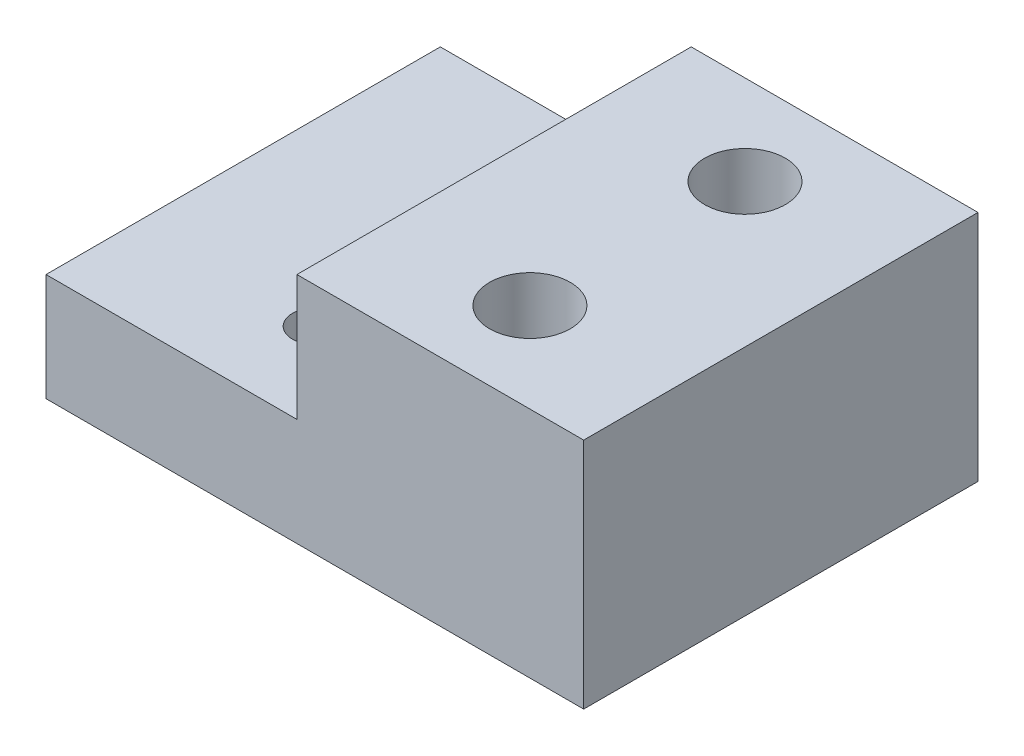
from build123d import *

# Parameters (mm, degrees)
EXTRUDE_1_DEPTH     = 22
HOLE_WIZARD_M31_D   = 2.5
SKETCH_4_R          = 2.25
CUT_EXTRUDE_1_DEPTH = 40.40812099
SKETCH_5_R          = 4
CUT_EXTRUDE_2_DEPTH = 5.5
CHAMFER_1_SIZE      = 0.5


with BuildPart() as part:
    # Sketch 1 → Extrude 1 (new body)
    with BuildSketch(Plane.XY):
        Polygon((-30, 0), (0, 0), (0, 13), (-16, 13), (-16, 6), (-30, 6), align=None)
    extrude(amount=-EXTRUDE_1_DEPTH)

    # Hole Wizard M31 (through all)
    with Locations(Plane(origin=(0, 6, 0), x_dir=(1, 0, 0), z_dir=(0, 1, 0))):
        with Locations((-20, 5), (-20, 17)):
            Hole(HOLE_WIZARD_M31_D / 2)

    # Sketch 4 → Cut-Extrude 1 (cut, through all)
    with BuildSketch(Plane(origin=(0, 13, 0), x_dir=(1, 0, 0), z_dir=(0, 1, 0))):
        with Locations(Location((-8, 17, 0), (0, 0, 180))):
            Circle(SKETCH_4_R)
        with Locations(Location((-8, 5, 0), (0, 0, 180))):
            Circle(SKETCH_4_R)
    extrude(amount=-CUT_EXTRUDE_1_DEPTH, mode=Mode.SUBTRACT)

    # Sketch 5 → Cut-Extrude 2 (cut)
    with BuildSketch(Plane.XZ):
        with Locations(Location((-8, -5, 0), (0, 0, 270))):
            Circle(SKETCH_5_R)
        with Locations(Location((-8, -17, 0), (0, 0, 270))):
            Circle(SKETCH_5_R)
    extrude(amount=-CUT_EXTRUDE_2_DEPTH, mode=Mode.SUBTRACT)

    # Chamfer 1
    chamfer_1_edges = [part.edges().sort_by_distance(p)[0] for p in [
        (-18.75, 0, -17),
        (-18.75, 0, -5),
    ]]
    chamfer(chamfer_1_edges, length=CHAMFER_1_SIZE)


solid = part.part
